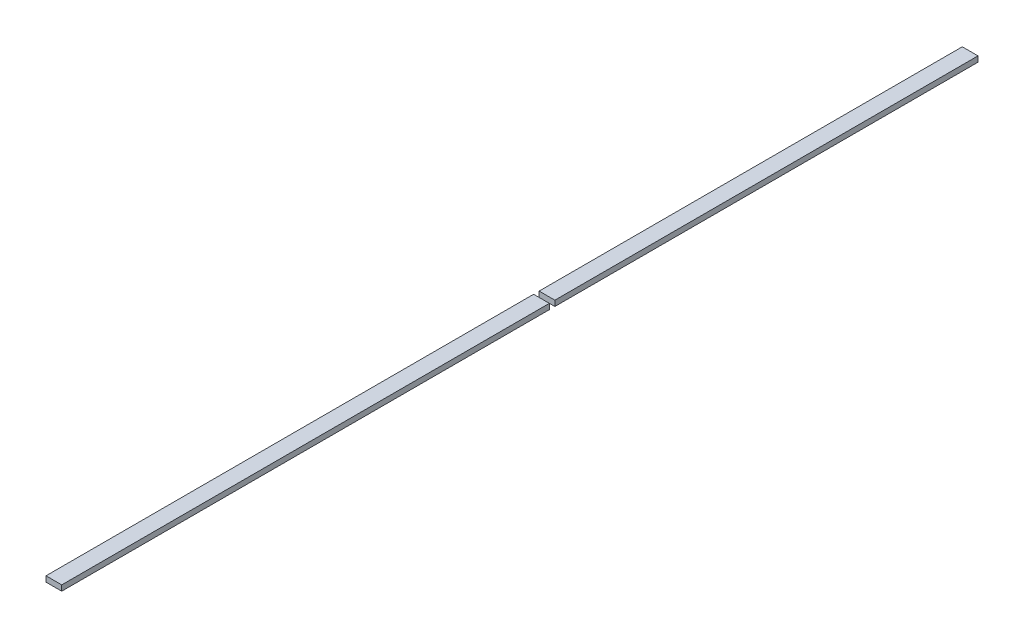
ISO-10303-21;
HEADER;
FILE_DESCRIPTION(('STEP AP214'),'2;1');
FILE_NAME('part.step','',(''),(''),'','','');
FILE_SCHEMA(('AUTOMOTIVE_DESIGN { 1 0 10303 214 1 1 1 1 }'));
ENDSEC;
DATA;
#1=APPLICATION_CONTEXT('core data for automotive mechanical design processes');
#2=APPLICATION_PROTOCOL_DEFINITION('international standard','automotive_design',2000,#1);
#3=PRODUCT_CONTEXT('',#1,'mechanical');
#4=PRODUCT('Part','Part','',(#3));
#5=PRODUCT_RELATED_PRODUCT_CATEGORY('part','',(#4));
#6=PRODUCT_DEFINITION_FORMATION('','',#4);
#7=PRODUCT_DEFINITION_CONTEXT('part definition',#1,'design');
#8=PRODUCT_DEFINITION('design','',#6,#7);
#9=PRODUCT_DEFINITION_SHAPE('','',#8);
#10=(LENGTH_UNIT() NAMED_UNIT(*) SI_UNIT(.MILLI.,.METRE.));
#11=(NAMED_UNIT(*) PLANE_ANGLE_UNIT() SI_UNIT($,.RADIAN.));
#12=(NAMED_UNIT(*) SI_UNIT($,.STERADIAN.) SOLID_ANGLE_UNIT());
#13=UNCERTAINTY_MEASURE_WITH_UNIT(LENGTH_MEASURE(1.E-05),#10,'distance_accuracy_value','');
#14=(GEOMETRIC_REPRESENTATION_CONTEXT(3) GLOBAL_UNCERTAINTY_ASSIGNED_CONTEXT((#13)) GLOBAL_UNIT_ASSIGNED_CONTEXT((#10,
#11,#12)) REPRESENTATION_CONTEXT('',''));
#15=CARTESIAN_POINT('',(0.,0.,0.));
#16=DIRECTION('',(0.,0.,1.));
#17=DIRECTION('',(1.,0.,0.));
#18=AXIS2_PLACEMENT_3D('',#15,#16,#17);
#19=CARTESIAN_POINT('',(20.,-7.,1165.));
#20=DIRECTION('',(-1.,0.,0.));
#21=DIRECTION('',(0.,0.,1.));
#22=AXIS2_PLACEMENT_3D('',#19,#20,#21);
#23=PLANE('',#22);
#24=DIRECTION('',(0.,0.,-1.));
#25=VECTOR('',#24,1.);
#26=CARTESIAN_POINT('',(20.,7.,1165.));
#27=LINE('',#26,#25);
#28=CARTESIAN_POINT('',(20.,7.,-89.));
#29=VERTEX_POINT('',#28);
#30=CARTESIAN_POINT('',(20.,7.,-1165.));
#31=VERTEX_POINT('',#30);
#32=EDGE_CURVE('E89',#29,#31,#27,.T.);
#33=ORIENTED_EDGE('',*,*,#32,.F.);
#34=DIRECTION('',(0.,-1.,0.));
#35=VECTOR('',#34,1.);
#36=CARTESIAN_POINT('',(20.,7.,-89.));
#37=LINE('',#36,#35);
#38=CARTESIAN_POINT('',(20.,-7.,-89.));
#39=VERTEX_POINT('',#38);
#40=EDGE_CURVE('E77',#29,#39,#37,.T.);
#41=ORIENTED_EDGE('',*,*,#40,.T.);
#42=DIRECTION('',(0.,0.,-1.));
#43=VECTOR('',#42,1.);
#44=CARTESIAN_POINT('',(20.,-7.,1165.));
#45=LINE('',#44,#43);
#46=CARTESIAN_POINT('',(20.,-7.,-1165.));
#47=VERTEX_POINT('',#46);
#48=EDGE_CURVE('E46',#39,#47,#45,.T.);
#49=ORIENTED_EDGE('',*,*,#48,.T.);
#50=DIRECTION('',(0.,1.,0.));
#51=VECTOR('',#50,1.);
#52=CARTESIAN_POINT('',(20.,-7.,-1165.));
#53=LINE('',#52,#51);
#54=EDGE_CURVE('E92',#47,#31,#53,.T.);
#55=ORIENTED_EDGE('',*,*,#54,.T.);
#56=EDGE_LOOP('',(#33,#41,#49,#55));
#57=FACE_BOUND('',#56,.T.);
#58=ADVANCED_FACE('F43',(#57),#23,.F.);
#59=CARTESIAN_POINT('',(-20.,7.,1165.));
#60=DIRECTION('',(0.,-1.,0.));
#61=DIRECTION('',(0.,0.,-1.));
#62=AXIS2_PLACEMENT_3D('',#59,#60,#61);
#63=PLANE('',#62);
#64=DIRECTION('',(0.,0.,-1.));
#65=VECTOR('',#64,1.);
#66=CARTESIAN_POINT('',(-20.,7.,1165.));
#67=LINE('',#66,#65);
#68=CARTESIAN_POINT('',(-20.,7.,-89.));
#69=VERTEX_POINT('',#68);
#70=CARTESIAN_POINT('',(-20.,7.,-1165.));
#71=VERTEX_POINT('',#70);
#72=EDGE_CURVE('E91',#69,#71,#67,.T.);
#73=ORIENTED_EDGE('',*,*,#72,.F.);
#74=DIRECTION('',(1.,0.,0.));
#75=VECTOR('',#74,1.);
#76=CARTESIAN_POINT('',(-20.,7.,-89.));
#77=LINE('',#76,#75);
#78=EDGE_CURVE('E80',#69,#29,#77,.T.);
#79=ORIENTED_EDGE('',*,*,#78,.T.);
#80=ORIENTED_EDGE('',*,*,#32,.T.);
#81=DIRECTION('',(-1.,0.,0.));
#82=VECTOR('',#81,1.);
#83=CARTESIAN_POINT('',(-20.,7.,-1165.));
#84=LINE('',#83,#82);
#85=EDGE_CURVE('E96',#31,#71,#84,.T.);
#86=ORIENTED_EDGE('',*,*,#85,.T.);
#87=EDGE_LOOP('',(#73,#79,#80,#86));
#88=FACE_BOUND('',#87,.T.);
#89=ADVANCED_FACE('F87',(#88),#63,.F.);
#90=CARTESIAN_POINT('',(-20.,-7.,1165.));
#91=DIRECTION('',(1.,0.,0.));
#92=DIRECTION('',(0.,0.,-1.));
#93=AXIS2_PLACEMENT_3D('',#90,#91,#92);
#94=PLANE('',#93);
#95=DIRECTION('',(0.,0.,-1.));
#96=VECTOR('',#95,1.);
#97=CARTESIAN_POINT('',(-20.,-7.,1165.));
#98=LINE('',#97,#96);
#99=CARTESIAN_POINT('',(-20.,-7.,-89.));
#100=VERTEX_POINT('',#99);
#101=CARTESIAN_POINT('',(-20.,-7.,-1165.));
#102=VERTEX_POINT('',#101);
#103=EDGE_CURVE('E102',#100,#102,#98,.T.);
#104=ORIENTED_EDGE('',*,*,#103,.F.);
#105=DIRECTION('',(0.,-1.,0.));
#106=VECTOR('',#105,1.);
#107=CARTESIAN_POINT('',(-20.,7.,-89.));
#108=LINE('',#107,#106);
#109=EDGE_CURVE('E12',#69,#100,#108,.T.);
#110=ORIENTED_EDGE('',*,*,#109,.F.);
#111=ORIENTED_EDGE('',*,*,#72,.T.);
#112=DIRECTION('',(0.,-1.,0.));
#113=VECTOR('',#112,1.);
#114=CARTESIAN_POINT('',(-20.,-7.,-1165.));
#115=LINE('',#114,#113);
#116=EDGE_CURVE('E101',#71,#102,#115,.T.);
#117=ORIENTED_EDGE('',*,*,#116,.T.);
#118=EDGE_LOOP('',(#104,#110,#111,#117));
#119=FACE_BOUND('',#118,.T.);
#120=ADVANCED_FACE('F124',(#119),#94,.F.);
#121=CARTESIAN_POINT('',(-20.,-7.,1165.));
#122=DIRECTION('',(0.,1.,0.));
#123=DIRECTION('',(0.,0.,1.));
#124=AXIS2_PLACEMENT_3D('',#121,#122,#123);
#125=PLANE('',#124);
#126=ORIENTED_EDGE('',*,*,#48,.F.);
#127=DIRECTION('',(1.,0.,0.));
#128=VECTOR('',#127,1.);
#129=CARTESIAN_POINT('',(-20.,-7.,-89.));
#130=LINE('',#129,#128);
#131=EDGE_CURVE('E52',#100,#39,#130,.T.);
#132=ORIENTED_EDGE('',*,*,#131,.F.);
#133=ORIENTED_EDGE('',*,*,#103,.T.);
#134=DIRECTION('',(1.,0.,0.));
#135=VECTOR('',#134,1.);
#136=CARTESIAN_POINT('',(-20.,-7.,-1165.));
#137=LINE('',#136,#135);
#138=EDGE_CURVE('E103',#102,#47,#137,.T.);
#139=ORIENTED_EDGE('',*,*,#138,.T.);
#140=EDGE_LOOP('',(#126,#132,#133,#139));
#141=FACE_BOUND('',#140,.T.);
#142=ADVANCED_FACE('F114',(#141),#125,.F.);
#143=CARTESIAN_POINT('',(0.,0.,-1165.));
#144=DIRECTION('',(0.,0.,-1.));
#145=DIRECTION('',(-1.,0.,0.));
#146=AXIS2_PLACEMENT_3D('',#143,#144,#145);
#147=PLANE('',#146);
#148=ORIENTED_EDGE('',*,*,#54,.F.);
#149=ORIENTED_EDGE('',*,*,#138,.F.);
#150=ORIENTED_EDGE('',*,*,#116,.F.);
#151=ORIENTED_EDGE('',*,*,#85,.F.);
#152=EDGE_LOOP('',(#148,#149,#150,#151));
#153=FACE_BOUND('',#152,.T.);
#154=ADVANCED_FACE('F116',(#153),#147,.T.);
#155=CARTESIAN_POINT('',(-20.,7.,-89.));
#156=DIRECTION('',(0.,0.,-1.));
#157=DIRECTION('',(-1.,0.,0.));
#158=AXIS2_PLACEMENT_3D('',#155,#156,#157);
#159=PLANE('',#158);
#160=ORIENTED_EDGE('',*,*,#131,.T.);
#161=ORIENTED_EDGE('',*,*,#40,.F.);
#162=ORIENTED_EDGE('',*,*,#78,.F.);
#163=ORIENTED_EDGE('',*,*,#109,.T.);
#164=EDGE_LOOP('',(#160,#161,#162,#163));
#165=FACE_BOUND('',#164,.T.);
#166=ADVANCED_FACE('F79',(#165),#159,.F.);
#167=CLOSED_SHELL('',(#58,#89,#120,#142,#154,#166));
#168=MANIFOLD_SOLID_BREP('B2',#167);
#169=CARTESIAN_POINT('',(0.,0.,1165.));
#170=DIRECTION('',(0.,0.,-1.));
#171=DIRECTION('',(-1.,0.,0.));
#172=AXIS2_PLACEMENT_3D('',#169,#170,#171);
#173=PLANE('',#172);
#174=DIRECTION('',(0.,1.,0.));
#175=VECTOR('',#174,1.);
#176=CARTESIAN_POINT('',(20.,-7.,1165.));
#177=LINE('',#176,#175);
#178=CARTESIAN_POINT('',(20.,-7.,1165.));
#179=VERTEX_POINT('',#178);
#180=CARTESIAN_POINT('',(20.,7.,1165.));
#181=VERTEX_POINT('',#180);
#182=EDGE_CURVE('E226',#179,#181,#177,.T.);
#183=ORIENTED_EDGE('',*,*,#182,.T.);
#184=DIRECTION('',(-1.,0.,0.));
#185=VECTOR('',#184,1.);
#186=CARTESIAN_POINT('',(-20.,7.,1165.));
#187=LINE('',#186,#185);
#188=CARTESIAN_POINT('',(-20.,7.,1165.));
#189=VERTEX_POINT('',#188);
#190=EDGE_CURVE('E223',#181,#189,#187,.T.);
#191=ORIENTED_EDGE('',*,*,#190,.T.);
#192=DIRECTION('',(0.,-1.,0.));
#193=VECTOR('',#192,1.);
#194=CARTESIAN_POINT('',(-20.,-7.,1165.));
#195=LINE('',#194,#193);
#196=CARTESIAN_POINT('',(-20.,-7.,1165.));
#197=VERTEX_POINT('',#196);
#198=EDGE_CURVE('E225',#189,#197,#195,.T.);
#199=ORIENTED_EDGE('',*,*,#198,.T.);
#200=DIRECTION('',(1.,0.,0.));
#201=VECTOR('',#200,1.);
#202=CARTESIAN_POINT('',(-20.,-7.,1165.));
#203=LINE('',#202,#201);
#204=EDGE_CURVE('E190',#197,#179,#203,.T.);
#205=ORIENTED_EDGE('',*,*,#204,.T.);
#206=EDGE_LOOP('',(#183,#191,#199,#205));
#207=FACE_BOUND('',#206,.T.);
#208=ADVANCED_FACE('F167',(#207),#173,.F.);
#209=CARTESIAN_POINT('',(-20.,-7.,1165.));
#210=DIRECTION('',(0.,1.,0.));
#211=DIRECTION('',(0.,0.,1.));
#212=AXIS2_PLACEMENT_3D('',#209,#210,#211);
#213=PLANE('',#212);
#214=DIRECTION('',(0.,0.,-1.));
#215=VECTOR('',#214,1.);
#216=CARTESIAN_POINT('',(-20.,-7.,1165.));
#217=LINE('',#216,#215);
#218=CARTESIAN_POINT('',(-20.,-7.,-75.));
#219=VERTEX_POINT('',#218);
#220=EDGE_CURVE('E234',#197,#219,#217,.T.);
#221=ORIENTED_EDGE('',*,*,#220,.T.);
#222=DIRECTION('',(-1.,0.,0.));
#223=VECTOR('',#222,1.);
#224=CARTESIAN_POINT('',(-20.,-7.,-75.));
#225=LINE('',#224,#223);
#226=CARTESIAN_POINT('',(20.,-7.,-75.));
#227=VERTEX_POINT('',#226);
#228=EDGE_CURVE('E214',#227,#219,#225,.T.);
#229=ORIENTED_EDGE('',*,*,#228,.F.);
#230=DIRECTION('',(0.,0.,-1.));
#231=VECTOR('',#230,1.);
#232=CARTESIAN_POINT('',(20.,-7.,1165.));
#233=LINE('',#232,#231);
#234=EDGE_CURVE('E220',#179,#227,#233,.T.);
#235=ORIENTED_EDGE('',*,*,#234,.F.);
#236=ORIENTED_EDGE('',*,*,#204,.F.);
#237=EDGE_LOOP('',(#221,#229,#235,#236));
#238=FACE_BOUND('',#237,.T.);
#239=ADVANCED_FACE('F240',(#238),#213,.F.);
#240=CARTESIAN_POINT('',(-20.,-7.,1165.));
#241=DIRECTION('',(1.,0.,0.));
#242=DIRECTION('',(0.,0.,-1.));
#243=AXIS2_PLACEMENT_3D('',#240,#241,#242);
#244=PLANE('',#243);
#245=DIRECTION('',(0.,0.,-1.));
#246=VECTOR('',#245,1.);
#247=CARTESIAN_POINT('',(-20.,7.,1165.));
#248=LINE('',#247,#246);
#249=CARTESIAN_POINT('',(-20.,7.,-75.));
#250=VERTEX_POINT('',#249);
#251=EDGE_CURVE('E175',#189,#250,#248,.T.);
#252=ORIENTED_EDGE('',*,*,#251,.T.);
#253=DIRECTION('',(0.,-1.,0.));
#254=VECTOR('',#253,1.);
#255=CARTESIAN_POINT('',(-20.,7.,-75.));
#256=LINE('',#255,#254);
#257=EDGE_CURVE('E210',#250,#219,#256,.T.);
#258=ORIENTED_EDGE('',*,*,#257,.T.);
#259=ORIENTED_EDGE('',*,*,#220,.F.);
#260=ORIENTED_EDGE('',*,*,#198,.F.);
#261=EDGE_LOOP('',(#252,#258,#259,#260));
#262=FACE_BOUND('',#261,.T.);
#263=ADVANCED_FACE('F237',(#262),#244,.F.);
#264=CARTESIAN_POINT('',(-20.,7.,1165.));
#265=DIRECTION('',(0.,-1.,0.));
#266=DIRECTION('',(0.,0.,-1.));
#267=AXIS2_PLACEMENT_3D('',#264,#265,#266);
#268=PLANE('',#267);
#269=DIRECTION('',(0.,0.,-1.));
#270=VECTOR('',#269,1.);
#271=CARTESIAN_POINT('',(20.,7.,1165.));
#272=LINE('',#271,#270);
#273=CARTESIAN_POINT('',(20.,7.,-75.));
#274=VERTEX_POINT('',#273);
#275=EDGE_CURVE('E41',#181,#274,#272,.T.);
#276=ORIENTED_EDGE('',*,*,#275,.T.);
#277=DIRECTION('',(-1.,0.,0.));
#278=VECTOR('',#277,1.);
#279=CARTESIAN_POINT('',(-20.,7.,-75.));
#280=LINE('',#279,#278);
#281=EDGE_CURVE('E207',#274,#250,#280,.T.);
#282=ORIENTED_EDGE('',*,*,#281,.T.);
#283=ORIENTED_EDGE('',*,*,#251,.F.);
#284=ORIENTED_EDGE('',*,*,#190,.F.);
#285=EDGE_LOOP('',(#276,#282,#283,#284));
#286=FACE_BOUND('',#285,.T.);
#287=ADVANCED_FACE('F222',(#286),#268,.F.);
#288=CARTESIAN_POINT('',(20.,-7.,1165.));
#289=DIRECTION('',(-1.,0.,0.));
#290=DIRECTION('',(0.,0.,1.));
#291=AXIS2_PLACEMENT_3D('',#288,#289,#290);
#292=PLANE('',#291);
#293=ORIENTED_EDGE('',*,*,#234,.T.);
#294=DIRECTION('',(0.,-1.,0.));
#295=VECTOR('',#294,1.);
#296=CARTESIAN_POINT('',(20.,7.,-75.));
#297=LINE('',#296,#295);
#298=EDGE_CURVE('E182',#274,#227,#297,.T.);
#299=ORIENTED_EDGE('',*,*,#298,.F.);
#300=ORIENTED_EDGE('',*,*,#275,.F.);
#301=ORIENTED_EDGE('',*,*,#182,.F.);
#302=EDGE_LOOP('',(#293,#299,#300,#301));
#303=FACE_BOUND('',#302,.T.);
#304=ADVANCED_FACE('F169',(#303),#292,.F.);
#305=CARTESIAN_POINT('',(-20.,7.,-75.));
#306=DIRECTION('',(0.,0.,1.));
#307=DIRECTION('',(1.,0.,0.));
#308=AXIS2_PLACEMENT_3D('',#305,#306,#307);
#309=PLANE('',#308);
#310=ORIENTED_EDGE('',*,*,#228,.T.);
#311=ORIENTED_EDGE('',*,*,#257,.F.);
#312=ORIENTED_EDGE('',*,*,#281,.F.);
#313=ORIENTED_EDGE('',*,*,#298,.T.);
#314=EDGE_LOOP('',(#310,#311,#312,#313));
#315=FACE_BOUND('',#314,.T.);
#316=ADVANCED_FACE('F208',(#315),#309,.F.);
#317=CLOSED_SHELL('',(#208,#239,#263,#287,#304,#316));
#318=MANIFOLD_SOLID_BREP('B6',#317);
#319=ADVANCED_BREP_SHAPE_REPRESENTATION('',(#18,#168,#318),#14);
#320=SHAPE_DEFINITION_REPRESENTATION(#9,#319);
ENDSEC;
END-ISO-10303-21;
